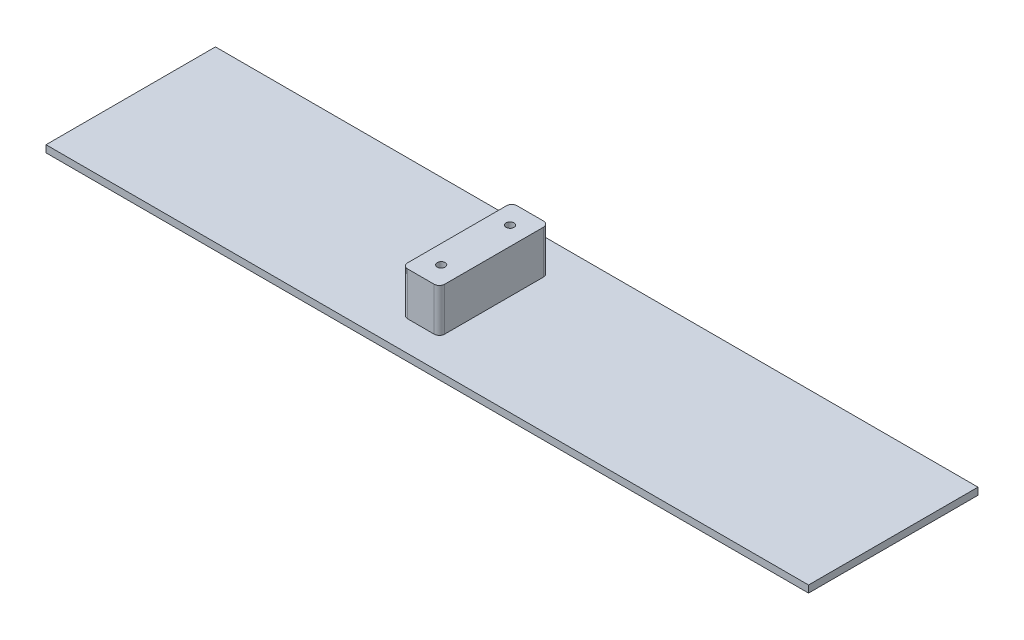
from build123d import *

# Parameters (mm, degrees)
SKETCH1_W      = 1371.6
SKETCH1_H      = 304.8
EXTRUDE1_DEPTH = 12.7
SKETCH2_R      = 7.14375
EXTRUDE2_DEPTH = 77.7875


with BuildPart() as part:
    # Sketch1 → Extrude1 (new body)
    with BuildSketch(Plane(origin=(0, 0, 0), x_dir=(1, 0, 0), z_dir=(0, 1, 0))):
        Rectangle(SKETCH1_W, SKETCH1_H)
    extrude(amount=-EXTRUDE1_DEPTH)

    # Sketch2 → Extrude2 (add)
    with BuildSketch(Plane(origin=(-68.021208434, 0, 0), x_dir=(-1, 0, 0), z_dir=(0, 1, 0))):
        with BuildLine():
            Line((-35.873271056, 88.9), (-35.873271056, -88.9))
            ThreePointArc((-35.873271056, -88.9), (-33.083463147, -95.635192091), (-26.348271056, -98.425))
            Line((-26.348271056, -98.425), (21.276728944, -98.425))
            ThreePointArc((21.276728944, -98.425), (28.011921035, -95.635192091), (30.801728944, -88.9))
            Line((30.801728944, -88.9), (30.801728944, 88.9))
            ThreePointArc((30.801728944, 88.9), (28.011921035, 95.635192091), (21.276728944, 98.425))
            Line((21.276728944, 98.425), (-26.348271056, 98.425))
            ThreePointArc((-26.348271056, 98.425), (-33.083463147, 95.635192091), (-35.873271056, 88.9))
        make_face()
        with Locations(Location((-2.535771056, 61.9125, 0), (0, 0, 90))):
            Circle(SKETCH2_R, mode=Mode.SUBTRACT)
        with Locations(Location((-2.535771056, -61.9125, 0), (0, 0, 90))):
            Circle(SKETCH2_R, mode=Mode.SUBTRACT)
    extrude(amount=EXTRUDE2_DEPTH)


solid = part.part
